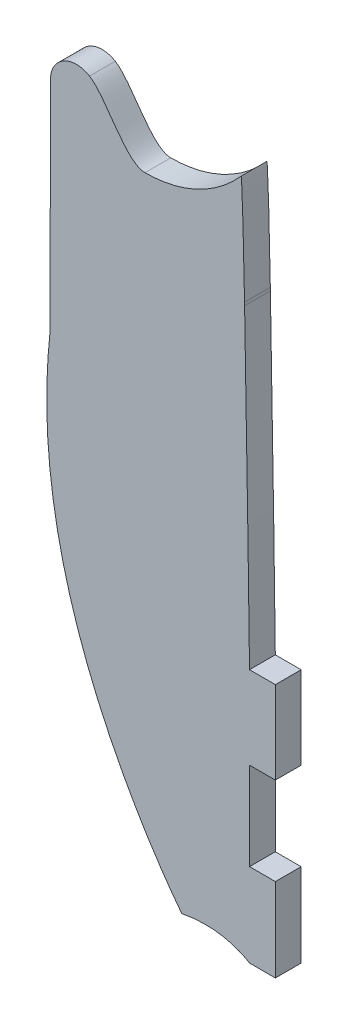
ISO-10303-21;
HEADER;
FILE_DESCRIPTION(('STEP AP214'),'2;1');
FILE_NAME('part.step','',(''),(''),'','','');
FILE_SCHEMA(('AUTOMOTIVE_DESIGN { 1 0 10303 214 1 1 1 1 }'));
ENDSEC;
DATA;
#1=APPLICATION_CONTEXT('core data for automotive mechanical design processes');
#2=APPLICATION_PROTOCOL_DEFINITION('international standard','automotive_design',2000,#1);
#3=PRODUCT_CONTEXT('',#1,'mechanical');
#4=PRODUCT('Part','Part','',(#3));
#5=PRODUCT_RELATED_PRODUCT_CATEGORY('part','',(#4));
#6=PRODUCT_DEFINITION_FORMATION('','',#4);
#7=PRODUCT_DEFINITION_CONTEXT('part definition',#1,'design');
#8=PRODUCT_DEFINITION('design','',#6,#7);
#9=PRODUCT_DEFINITION_SHAPE('','',#8);
#10=(LENGTH_UNIT() NAMED_UNIT(*) SI_UNIT(.MILLI.,.METRE.));
#11=(NAMED_UNIT(*) PLANE_ANGLE_UNIT() SI_UNIT($,.RADIAN.));
#12=(NAMED_UNIT(*) SI_UNIT($,.STERADIAN.) SOLID_ANGLE_UNIT());
#13=UNCERTAINTY_MEASURE_WITH_UNIT(LENGTH_MEASURE(1.E-05),#10,'distance_accuracy_value','');
#14=(GEOMETRIC_REPRESENTATION_CONTEXT(3) GLOBAL_UNCERTAINTY_ASSIGNED_CONTEXT((#13)) GLOBAL_UNIT_ASSIGNED_CONTEXT((#10,
#11,#12)) REPRESENTATION_CONTEXT('',''));
#15=CARTESIAN_POINT('',(0.,0.,0.));
#16=DIRECTION('',(0.,0.,1.));
#17=DIRECTION('',(1.,0.,0.));
#18=AXIS2_PLACEMENT_3D('',#15,#16,#17);
#19=CARTESIAN_POINT('',(835.767998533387,209.913527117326,3.));
#20=DIRECTION('',(0.,1.,0.));
#21=DIRECTION('',(0.,0.,1.));
#22=AXIS2_PLACEMENT_3D('',#19,#20,#21);
#23=PLANE('',#22);
#24=DIRECTION('',(1.,0.,0.));
#25=VECTOR('',#24,1.);
#26=CARTESIAN_POINT('',(835.767998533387,209.913527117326,0.));
#27=LINE('',#26,#25);
#28=CARTESIAN_POINT('',(835.767998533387,209.913527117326,0.));
#29=VERTEX_POINT('',#28);
#30=CARTESIAN_POINT('',(838.777203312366,209.913527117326,0.));
#31=VERTEX_POINT('',#30);
#32=EDGE_CURVE('E11',#29,#31,#27,.T.);
#33=ORIENTED_EDGE('',*,*,#32,.T.);
#34=DIRECTION('',(0.,0.,-1.));
#35=VECTOR('',#34,1.);
#36=CARTESIAN_POINT('',(838.777203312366,209.913527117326,3.));
#37=LINE('',#36,#35);
#38=CARTESIAN_POINT('',(838.777203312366,209.913527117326,3.));
#39=VERTEX_POINT('',#38);
#40=EDGE_CURVE('E196',#39,#31,#37,.T.);
#41=ORIENTED_EDGE('',*,*,#40,.F.);
#42=DIRECTION('',(1.,0.,0.));
#43=VECTOR('',#42,1.);
#44=CARTESIAN_POINT('',(835.767998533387,209.913527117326,3.));
#45=LINE('',#44,#43);
#46=CARTESIAN_POINT('',(835.767998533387,209.913527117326,3.));
#47=VERTEX_POINT('',#46);
#48=EDGE_CURVE('E129',#47,#39,#45,.T.);
#49=ORIENTED_EDGE('',*,*,#48,.F.);
#50=DIRECTION('',(0.,0.,-1.));
#51=VECTOR('',#50,1.);
#52=CARTESIAN_POINT('',(835.767998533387,209.913527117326,3.));
#53=LINE('',#52,#51);
#54=EDGE_CURVE('E471',#47,#29,#53,.T.);
#55=ORIENTED_EDGE('',*,*,#54,.T.);
#56=EDGE_LOOP('',(#33,#41,#49,#55));
#57=FACE_BOUND('',#56,.T.);
#58=ADVANCED_FACE('F44',(#57),#23,.F.);
#59=CARTESIAN_POINT('',(838.777203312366,209.913527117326,3.));
#60=DIRECTION('',(-1.,0.,0.));
#61=DIRECTION('',(0.,0.,1.));
#62=AXIS2_PLACEMENT_3D('',#59,#60,#61);
#63=PLANE('',#62);
#64=DIRECTION('',(0.,1.,0.));
#65=VECTOR('',#64,1.);
#66=CARTESIAN_POINT('',(838.777203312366,209.913527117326,0.));
#67=LINE('',#66,#65);
#68=CARTESIAN_POINT('',(838.777203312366,219.534817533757,0.));
#69=VERTEX_POINT('',#68);
#70=EDGE_CURVE('E57',#31,#69,#67,.T.);
#71=ORIENTED_EDGE('',*,*,#70,.T.);
#72=DIRECTION('',(0.,0.,-1.));
#73=VECTOR('',#72,1.);
#74=CARTESIAN_POINT('',(838.777203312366,219.534817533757,3.));
#75=LINE('',#74,#73);
#76=CARTESIAN_POINT('',(838.777203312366,219.534817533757,3.));
#77=VERTEX_POINT('',#76);
#78=EDGE_CURVE('E198',#77,#69,#75,.T.);
#79=ORIENTED_EDGE('',*,*,#78,.F.);
#80=DIRECTION('',(0.,1.,0.));
#81=VECTOR('',#80,1.);
#82=CARTESIAN_POINT('',(838.777203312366,209.913527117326,3.));
#83=LINE('',#82,#81);
#84=EDGE_CURVE('E308',#39,#77,#83,.T.);
#85=ORIENTED_EDGE('',*,*,#84,.F.);
#86=ORIENTED_EDGE('',*,*,#40,.T.);
#87=EDGE_LOOP('',(#71,#79,#85,#86));
#88=FACE_BOUND('',#87,.T.);
#89=ADVANCED_FACE('F191',(#88),#63,.F.);
#90=CARTESIAN_POINT('',(838.777203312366,219.534817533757,3.));
#91=DIRECTION('',(0.,-1.,0.));
#92=DIRECTION('',(0.,0.,-1.));
#93=AXIS2_PLACEMENT_3D('',#90,#91,#92);
#94=PLANE('',#93);
#95=DIRECTION('',(-1.,0.,0.));
#96=VECTOR('',#95,1.);
#97=CARTESIAN_POINT('',(838.777203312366,219.534817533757,0.));
#98=LINE('',#97,#96);
#99=CARTESIAN_POINT('',(835.767998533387,219.534817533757,0.));
#100=VERTEX_POINT('',#99);
#101=EDGE_CURVE('E201',#69,#100,#98,.T.);
#102=ORIENTED_EDGE('',*,*,#101,.T.);
#103=DIRECTION('',(0.,0.,-1.));
#104=VECTOR('',#103,1.);
#105=CARTESIAN_POINT('',(835.767998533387,219.534817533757,3.));
#106=LINE('',#105,#104);
#107=CARTESIAN_POINT('',(835.767998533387,219.534817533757,3.));
#108=VERTEX_POINT('',#107);
#109=EDGE_CURVE('E211',#108,#100,#106,.T.);
#110=ORIENTED_EDGE('',*,*,#109,.F.);
#111=DIRECTION('',(-1.,0.,0.));
#112=VECTOR('',#111,1.);
#113=CARTESIAN_POINT('',(838.777203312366,219.534817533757,3.));
#114=LINE('',#113,#112);
#115=EDGE_CURVE('E207',#77,#108,#114,.T.);
#116=ORIENTED_EDGE('',*,*,#115,.F.);
#117=ORIENTED_EDGE('',*,*,#78,.T.);
#118=EDGE_LOOP('',(#102,#110,#116,#117));
#119=FACE_BOUND('',#118,.T.);
#120=ADVANCED_FACE('F206',(#119),#94,.F.);
#121=CARTESIAN_POINT('',(835.767998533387,219.534817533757,3.));
#122=CARTESIAN_POINT('',(835.767998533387,219.879843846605,3.));
#123=CARTESIAN_POINT('',(835.486878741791,241.454237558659,3.));
#124=CARTESIAN_POINT('',(835.196457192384,255.926394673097,3.));
#125=B_SPLINE_CURVE_WITH_KNOTS('',3,(#121,#122,#123,#124),.UNSPECIFIED.,.F.,.F.,(4,4),(4.,5.),.UNSPECIFIED.);
#126=DIRECTION('',(0.,0.,-1.));
#127=VECTOR('',#126,1.);
#128=SURFACE_OF_LINEAR_EXTRUSION('',#125,#127);
#129=CARTESIAN_POINT('',(835.767998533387,219.534817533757,0.));
#130=CARTESIAN_POINT('',(835.767998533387,219.879843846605,0.));
#131=CARTESIAN_POINT('',(835.486878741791,241.454237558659,0.));
#132=CARTESIAN_POINT('',(835.196457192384,255.926394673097,0.));
#133=B_SPLINE_CURVE_WITH_KNOTS('',3,(#129,#130,#131,#132),.UNSPECIFIED.,.F.,.F.,(4,4),(4.,5.),.UNSPECIFIED.);
#134=CARTESIAN_POINT('',(835.196457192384,255.926394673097,0.));
#135=VERTEX_POINT('',#134);
#136=EDGE_CURVE('E216',#100,#135,#133,.T.);
#137=ORIENTED_EDGE('',*,*,#136,.T.);
#138=DIRECTION('',(0.,0.,-1.));
#139=VECTOR('',#138,1.);
#140=CARTESIAN_POINT('',(835.196457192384,255.926394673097,3.));
#141=LINE('',#140,#139);
#142=CARTESIAN_POINT('',(835.196457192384,255.926394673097,3.));
#143=VERTEX_POINT('',#142);
#144=EDGE_CURVE('E396',#143,#135,#141,.T.);
#145=ORIENTED_EDGE('',*,*,#144,.F.);
#146=EDGE_CURVE('E295',#108,#143,#125,.T.);
#147=ORIENTED_EDGE('',*,*,#146,.F.);
#148=ORIENTED_EDGE('',*,*,#109,.T.);
#149=EDGE_LOOP('',(#137,#145,#147,#148));
#150=FACE_BOUND('',#149,.T.);
#151=ADVANCED_FACE('F282',(#150),#128,.F.);
#152=CARTESIAN_POINT('',(835.196457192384,255.926394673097,3.));
#153=DIRECTION('',(-0.999790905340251,-0.0204486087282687,0.));
#154=DIRECTION('',(0.0204486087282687,-0.999790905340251,0.));
#155=AXIS2_PLACEMENT_3D('',#152,#153,#154);
#156=PLANE('',#155);
#157=DIRECTION('',(-0.0204486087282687,0.999790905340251,0.));
#158=VECTOR('',#157,1.);
#159=CARTESIAN_POINT('',(835.196457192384,255.926394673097,0.));
#160=LINE('',#159,#158);
#161=CARTESIAN_POINT('',(835.189222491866,256.280119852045,0.));
#162=VERTEX_POINT('',#161);
#163=EDGE_CURVE('E219',#135,#162,#160,.T.);
#164=ORIENTED_EDGE('',*,*,#163,.T.);
#165=DIRECTION('',(0.,0.,-1.));
#166=VECTOR('',#165,1.);
#167=CARTESIAN_POINT('',(835.189222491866,256.280119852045,3.));
#168=LINE('',#167,#166);
#169=CARTESIAN_POINT('',(835.189222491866,256.280119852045,3.));
#170=VERTEX_POINT('',#169);
#171=EDGE_CURVE('E397',#170,#162,#168,.T.);
#172=ORIENTED_EDGE('',*,*,#171,.F.);
#173=DIRECTION('',(-0.0204486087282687,0.999790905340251,0.));
#174=VECTOR('',#173,1.);
#175=CARTESIAN_POINT('',(835.196457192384,255.926394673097,3.));
#176=LINE('',#175,#174);
#177=EDGE_CURVE('E298',#143,#170,#176,.T.);
#178=ORIENTED_EDGE('',*,*,#177,.F.);
#179=ORIENTED_EDGE('',*,*,#144,.T.);
#180=EDGE_LOOP('',(#164,#172,#178,#179));
#181=FACE_BOUND('',#180,.T.);
#182=ADVANCED_FACE('F286',(#181),#156,.F.);
#183=CARTESIAN_POINT('',(835.189222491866,256.280119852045,3.));
#184=CARTESIAN_POINT('',(835.042633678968,263.520849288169,3.));
#185=CARTESIAN_POINT('',(834.894322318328,268.897523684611,3.));
#186=CARTESIAN_POINT('',(834.778997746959,268.767126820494,3.));
#187=B_SPLINE_CURVE_WITH_KNOTS('',3,(#183,#184,#185,#186),.UNSPECIFIED.,.F.,.F.,(4,4),(6.,7.),.UNSPECIFIED.);
#188=DIRECTION('',(0.,0.,-1.));
#189=VECTOR('',#188,1.);
#190=SURFACE_OF_LINEAR_EXTRUSION('',#187,#189);
#191=CARTESIAN_POINT('',(835.189222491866,256.280119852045,0.));
#192=CARTESIAN_POINT('',(835.042633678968,263.520849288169,0.));
#193=CARTESIAN_POINT('',(834.894322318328,268.897523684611,0.));
#194=CARTESIAN_POINT('',(834.778997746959,268.767126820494,0.));
#195=B_SPLINE_CURVE_WITH_KNOTS('',3,(#191,#192,#193,#194),.UNSPECIFIED.,.F.,.F.,(4,4),(6.,7.),.UNSPECIFIED.);
#196=CARTESIAN_POINT('',(834.778997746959,268.767126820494,0.));
#197=VERTEX_POINT('',#196);
#198=EDGE_CURVE('E379',#162,#197,#195,.T.);
#199=ORIENTED_EDGE('',*,*,#198,.T.);
#200=DIRECTION('',(0.,0.,-1.));
#201=VECTOR('',#200,1.);
#202=CARTESIAN_POINT('',(834.778997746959,268.767126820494,3.));
#203=LINE('',#202,#201);
#204=CARTESIAN_POINT('',(834.778997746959,268.767126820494,3.));
#205=VERTEX_POINT('',#204);
#206=EDGE_CURVE('E406',#205,#197,#203,.T.);
#207=ORIENTED_EDGE('',*,*,#206,.F.);
#208=EDGE_CURVE('E403',#170,#205,#187,.T.);
#209=ORIENTED_EDGE('',*,*,#208,.F.);
#210=ORIENTED_EDGE('',*,*,#171,.T.);
#211=EDGE_LOOP('',(#199,#207,#209,#210));
#212=FACE_BOUND('',#211,.T.);
#213=ADVANCED_FACE('F405',(#212),#190,.F.);
#214=CARTESIAN_POINT('',(834.778997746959,268.767126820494,3.));
#215=CARTESIAN_POINT('',(831.920688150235,265.536316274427,3.));
#216=CARTESIAN_POINT('',(827.968819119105,263.537816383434,3.));
#217=CARTESIAN_POINT('',(823.604227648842,263.537816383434,3.));
#218=B_SPLINE_CURVE_WITH_KNOTS('',3,(#214,#215,#216,#217),.UNSPECIFIED.,.F.,.F.,(4,4),(7.,8.),.UNSPECIFIED.);
#219=DIRECTION('',(0.,0.,-1.));
#220=VECTOR('',#219,1.);
#221=SURFACE_OF_LINEAR_EXTRUSION('',#218,#220);
#222=CARTESIAN_POINT('',(834.778997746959,268.767126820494,0.));
#223=CARTESIAN_POINT('',(831.920688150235,265.536316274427,0.));
#224=CARTESIAN_POINT('',(827.968819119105,263.537816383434,0.));
#225=CARTESIAN_POINT('',(823.604227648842,263.537816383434,0.));
#226=B_SPLINE_CURVE_WITH_KNOTS('',3,(#222,#223,#224,#225),.UNSPECIFIED.,.F.,.F.,(4,4),(7.,8.),.UNSPECIFIED.);
#227=CARTESIAN_POINT('',(823.604227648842,263.537816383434,0.));
#228=VERTEX_POINT('',#227);
#229=EDGE_CURVE('E375',#197,#228,#226,.T.);
#230=ORIENTED_EDGE('',*,*,#229,.T.);
#231=DIRECTION('',(0.,0.,-1.));
#232=VECTOR('',#231,1.);
#233=CARTESIAN_POINT('',(823.604227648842,263.537816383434,3.));
#234=LINE('',#233,#232);
#235=CARTESIAN_POINT('',(823.604227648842,263.537816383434,3.));
#236=VERTEX_POINT('',#235);
#237=EDGE_CURVE('E417',#236,#228,#234,.T.);
#238=ORIENTED_EDGE('',*,*,#237,.F.);
#239=EDGE_CURVE('E484',#205,#236,#218,.T.);
#240=ORIENTED_EDGE('',*,*,#239,.F.);
#241=ORIENTED_EDGE('',*,*,#206,.T.);
#242=EDGE_LOOP('',(#230,#238,#240,#241));
#243=FACE_BOUND('',#242,.T.);
#244=ADVANCED_FACE('F413',(#243),#221,.F.);
#245=CARTESIAN_POINT('',(823.604227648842,263.537816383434,3.));
#246=CARTESIAN_POINT('',(821.305832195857,263.537816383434,3.));
#247=CARTESIAN_POINT('',(819.121813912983,268.851359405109,3.));
#248=CARTESIAN_POINT('',(817.151563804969,270.037850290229,3.));
#249=B_SPLINE_CURVE_WITH_KNOTS('',3,(#245,#246,#247,#248),.UNSPECIFIED.,.F.,.F.,(4,4),(8.,9.),.UNSPECIFIED.);
#250=DIRECTION('',(0.,0.,-1.));
#251=VECTOR('',#250,1.);
#252=SURFACE_OF_LINEAR_EXTRUSION('',#249,#251);
#253=CARTESIAN_POINT('',(823.604227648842,263.537816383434,0.));
#254=CARTESIAN_POINT('',(821.305832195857,263.537816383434,0.));
#255=CARTESIAN_POINT('',(819.121813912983,268.851359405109,0.));
#256=CARTESIAN_POINT('',(817.151563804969,270.037850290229,0.));
#257=B_SPLINE_CURVE_WITH_KNOTS('',3,(#253,#254,#255,#256),.UNSPECIFIED.,.F.,.F.,(4,4),(8.,9.),.UNSPECIFIED.);
#258=CARTESIAN_POINT('',(817.151563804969,270.037850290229,0.));
#259=VERTEX_POINT('',#258);
#260=EDGE_CURVE('E365',#228,#259,#257,.T.);
#261=ORIENTED_EDGE('',*,*,#260,.T.);
#262=DIRECTION('',(0.,0.,-1.));
#263=VECTOR('',#262,1.);
#264=CARTESIAN_POINT('',(817.151563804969,270.037850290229,3.));
#265=LINE('',#264,#263);
#266=CARTESIAN_POINT('',(817.151563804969,270.037850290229,3.));
#267=VERTEX_POINT('',#266);
#268=EDGE_CURVE('E422',#267,#259,#265,.T.);
#269=ORIENTED_EDGE('',*,*,#268,.F.);
#270=EDGE_CURVE('E421',#236,#267,#249,.T.);
#271=ORIENTED_EDGE('',*,*,#270,.F.);
#272=ORIENTED_EDGE('',*,*,#237,.T.);
#273=EDGE_LOOP('',(#261,#269,#271,#272));
#274=FACE_BOUND('',#273,.T.);
#275=ADVANCED_FACE('F419',(#274),#252,.F.);
#276=CARTESIAN_POINT('',(817.151563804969,270.037850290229,3.));
#277=CARTESIAN_POINT('',(815.161676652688,271.236054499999,3.));
#278=CARTESIAN_POINT('',(812.62470833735,269.777487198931,3.));
#279=CARTESIAN_POINT('',(812.611875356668,267.454717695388,3.));
#280=B_SPLINE_CURVE_WITH_KNOTS('',3,(#276,#277,#278,#279),.UNSPECIFIED.,.F.,.F.,(4,4),(9.,10.),.UNSPECIFIED.);
#281=DIRECTION('',(0.,0.,-1.));
#282=VECTOR('',#281,1.);
#283=SURFACE_OF_LINEAR_EXTRUSION('',#280,#282);
#284=CARTESIAN_POINT('',(817.151563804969,270.037850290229,0.));
#285=CARTESIAN_POINT('',(815.161676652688,271.236054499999,0.));
#286=CARTESIAN_POINT('',(812.62470833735,269.777487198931,0.));
#287=CARTESIAN_POINT('',(812.611875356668,267.454717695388,0.));
#288=B_SPLINE_CURVE_WITH_KNOTS('',3,(#284,#285,#286,#287),.UNSPECIFIED.,.F.,.F.,(4,4),(9.,10.),.UNSPECIFIED.);
#289=CARTESIAN_POINT('',(812.611875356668,267.454717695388,0.));
#290=VERTEX_POINT('',#289);
#291=EDGE_CURVE('E356',#259,#290,#288,.T.);
#292=ORIENTED_EDGE('',*,*,#291,.T.);
#293=DIRECTION('',(0.,0.,-1.));
#294=VECTOR('',#293,1.);
#295=CARTESIAN_POINT('',(812.611875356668,267.454717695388,3.));
#296=LINE('',#295,#294);
#297=CARTESIAN_POINT('',(812.611875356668,267.454717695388,3.));
#298=VERTEX_POINT('',#297);
#299=EDGE_CURVE('E427',#298,#290,#296,.T.);
#300=ORIENTED_EDGE('',*,*,#299,.F.);
#301=EDGE_CURVE('E512',#267,#298,#280,.T.);
#302=ORIENTED_EDGE('',*,*,#301,.F.);
#303=ORIENTED_EDGE('',*,*,#268,.T.);
#304=EDGE_LOOP('',(#292,#300,#302,#303));
#305=FACE_BOUND('',#304,.T.);
#306=ADVANCED_FACE('F503',(#305),#283,.F.);
#307=CARTESIAN_POINT('',(812.611875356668,267.454717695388,3.));
#308=DIRECTION('',(0.999997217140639,-0.00235917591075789,0.));
#309=DIRECTION('',(0.00235917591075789,0.999997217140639,0.));
#310=AXIS2_PLACEMENT_3D('',#307,#308,#309);
#311=PLANE('',#310);
#312=DIRECTION('',(-0.00235917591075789,-0.999997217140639,0.));
#313=VECTOR('',#312,1.);
#314=CARTESIAN_POINT('',(812.611875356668,267.454717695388,0.));
#315=LINE('',#314,#313);
#316=CARTESIAN_POINT('',(812.578630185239,253.362899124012,0.));
#317=VERTEX_POINT('',#316);
#318=EDGE_CURVE('E357',#290,#317,#315,.T.);
#319=ORIENTED_EDGE('',*,*,#318,.T.);
#320=DIRECTION('',(0.,0.,-1.));
#321=VECTOR('',#320,1.);
#322=CARTESIAN_POINT('',(812.578630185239,253.362899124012,3.));
#323=LINE('',#322,#321);
#324=CARTESIAN_POINT('',(812.578630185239,253.362899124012,3.));
#325=VERTEX_POINT('',#324);
#326=EDGE_CURVE('E436',#325,#317,#323,.T.);
#327=ORIENTED_EDGE('',*,*,#326,.F.);
#328=DIRECTION('',(-0.00235917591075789,-0.999997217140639,0.));
#329=VECTOR('',#328,1.);
#330=CARTESIAN_POINT('',(812.611875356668,267.454717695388,3.));
#331=LINE('',#330,#329);
#332=EDGE_CURVE('E517',#298,#325,#331,.T.);
#333=ORIENTED_EDGE('',*,*,#332,.F.);
#334=ORIENTED_EDGE('',*,*,#299,.T.);
#335=EDGE_LOOP('',(#319,#327,#333,#334));
#336=FACE_BOUND('',#335,.T.);
#337=ADVANCED_FACE('F588',(#336),#311,.F.);
#338=CARTESIAN_POINT('',(812.578630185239,253.362899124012,3.));
#339=DIRECTION('',(0.999997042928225,-0.00243189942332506,0.));
#340=DIRECTION('',(0.00243189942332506,0.999997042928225,0.));
#341=AXIS2_PLACEMENT_3D('',#338,#339,#340);
#342=PLANE('',#341);
#343=DIRECTION('',(-0.00243189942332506,-0.999997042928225,0.));
#344=VECTOR('',#343,1.);
#345=CARTESIAN_POINT('',(812.578630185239,253.362899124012,0.));
#346=LINE('',#345,#344);
#347=CARTESIAN_POINT('',(812.577768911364,253.008743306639,0.));
#348=VERTEX_POINT('',#347);
#349=EDGE_CURVE('E355',#317,#348,#346,.T.);
#350=ORIENTED_EDGE('',*,*,#349,.T.);
#351=DIRECTION('',(0.,0.,-1.));
#352=VECTOR('',#351,1.);
#353=CARTESIAN_POINT('',(812.577768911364,253.008743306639,3.));
#354=LINE('',#353,#352);
#355=CARTESIAN_POINT('',(812.577768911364,253.008743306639,3.));
#356=VERTEX_POINT('',#355);
#357=EDGE_CURVE('E439',#356,#348,#354,.T.);
#358=ORIENTED_EDGE('',*,*,#357,.F.);
#359=DIRECTION('',(-0.00243189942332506,-0.999997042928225,0.));
#360=VECTOR('',#359,1.);
#361=CARTESIAN_POINT('',(812.578630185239,253.362899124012,3.));
#362=LINE('',#361,#360);
#363=EDGE_CURVE('E528',#325,#356,#362,.T.);
#364=ORIENTED_EDGE('',*,*,#363,.F.);
#365=ORIENTED_EDGE('',*,*,#326,.T.);
#366=EDGE_LOOP('',(#350,#358,#364,#365));
#367=FACE_BOUND('',#366,.T.);
#368=ADVANCED_FACE('F582',(#367),#342,.F.);
#369=CARTESIAN_POINT('',(812.577768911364,253.008743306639,3.));
#370=DIRECTION('',(0.999997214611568,-0.00236024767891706,0.));
#371=DIRECTION('',(0.00236024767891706,0.999997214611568,0.));
#372=AXIS2_PLACEMENT_3D('',#369,#370,#371);
#373=PLANE('',#372);
#374=DIRECTION('',(-0.00236024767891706,-0.999997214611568,0.));
#375=VECTOR('',#374,1.);
#376=CARTESIAN_POINT('',(812.577768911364,253.008743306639,0.));
#377=LINE('',#376,#375);
#378=CARTESIAN_POINT('',(812.551672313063,241.952053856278,0.));
#379=VERTEX_POINT('',#378);
#380=EDGE_CURVE('E350',#348,#379,#377,.T.);
#381=ORIENTED_EDGE('',*,*,#380,.T.);
#382=DIRECTION('',(0.,0.,-1.));
#383=VECTOR('',#382,1.);
#384=CARTESIAN_POINT('',(812.551672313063,241.952053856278,3.));
#385=LINE('',#384,#383);
#386=CARTESIAN_POINT('',(812.551672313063,241.952053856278,3.));
#387=VERTEX_POINT('',#386);
#388=EDGE_CURVE('E441',#387,#379,#385,.T.);
#389=ORIENTED_EDGE('',*,*,#388,.F.);
#390=DIRECTION('',(-0.00236024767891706,-0.999997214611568,0.));
#391=VECTOR('',#390,1.);
#392=CARTESIAN_POINT('',(812.577768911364,253.008743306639,3.));
#393=LINE('',#392,#391);
#394=EDGE_CURVE('E530',#356,#387,#393,.T.);
#395=ORIENTED_EDGE('',*,*,#394,.F.);
#396=ORIENTED_EDGE('',*,*,#357,.T.);
#397=EDGE_LOOP('',(#381,#389,#395,#396));
#398=FACE_BOUND('',#397,.T.);
#399=ADVANCED_FACE('F546',(#398),#373,.F.);
#400=CARTESIAN_POINT('',(812.551672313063,241.952053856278,3.));
#401=CARTESIAN_POINT('',(810.095491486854,219.183073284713,3.));
#402=CARTESIAN_POINT('',(823.676746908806,197.12559105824,3.));
#403=B_SPLINE_CURVE_WITH_KNOTS('',2,(#400,#401,#402),.UNSPECIFIED.,.F.,.F.,(3,3),(13.,14.),.UNSPECIFIED.);
#404=DIRECTION('',(0.,0.,-1.));
#405=VECTOR('',#404,1.);
#406=SURFACE_OF_LINEAR_EXTRUSION('',#403,#405);
#407=CARTESIAN_POINT('',(812.551672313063,241.952053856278,0.));
#408=CARTESIAN_POINT('',(810.095491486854,219.183073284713,0.));
#409=CARTESIAN_POINT('',(823.676746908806,197.12559105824,0.));
#410=B_SPLINE_CURVE_WITH_KNOTS('',2,(#407,#408,#409),.UNSPECIFIED.,.F.,.F.,(3,3),(13.,14.),.UNSPECIFIED.);
#411=CARTESIAN_POINT('',(823.676746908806,197.12559105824,0.));
#412=VERTEX_POINT('',#411);
#413=EDGE_CURVE('E344',#379,#412,#410,.T.);
#414=ORIENTED_EDGE('',*,*,#413,.T.);
#415=DIRECTION('',(0.,0.,-1.));
#416=VECTOR('',#415,1.);
#417=CARTESIAN_POINT('',(823.676746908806,197.12559105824,3.));
#418=LINE('',#417,#416);
#419=CARTESIAN_POINT('',(823.676746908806,197.12559105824,3.));
#420=VERTEX_POINT('',#419);
#421=EDGE_CURVE('E450',#420,#412,#418,.T.);
#422=ORIENTED_EDGE('',*,*,#421,.F.);
#423=EDGE_CURVE('E535',#387,#420,#403,.T.);
#424=ORIENTED_EDGE('',*,*,#423,.F.);
#425=ORIENTED_EDGE('',*,*,#388,.T.);
#426=EDGE_LOOP('',(#414,#422,#424,#425));
#427=FACE_BOUND('',#426,.T.);
#428=ADVANCED_FACE('F545',(#427),#406,.F.);
#429=CARTESIAN_POINT('',(823.676746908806,197.12559105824,3.));
#430=DIRECTION('',(0.852165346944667,0.523272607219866,0.));
#431=DIRECTION('',(-0.523272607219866,0.852165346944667,0.));
#432=AXIS2_PLACEMENT_3D('',#429,#430,#431);
#433=PLANE('',#432);
#434=DIRECTION('',(0.523272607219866,-0.852165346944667,0.));
#435=VECTOR('',#434,1.);
#436=CARTESIAN_POINT('',(823.676746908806,197.12559105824,0.));
#437=LINE('',#436,#435);
#438=CARTESIAN_POINT('',(823.856667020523,196.832585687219,0.));
#439=VERTEX_POINT('',#438);
#440=EDGE_CURVE('E339',#412,#439,#437,.T.);
#441=ORIENTED_EDGE('',*,*,#440,.T.);
#442=DIRECTION('',(0.,0.,-1.));
#443=VECTOR('',#442,1.);
#444=CARTESIAN_POINT('',(823.856667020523,196.832585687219,3.));
#445=LINE('',#444,#443);
#446=CARTESIAN_POINT('',(823.856667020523,196.832585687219,3.));
#447=VERTEX_POINT('',#446);
#448=EDGE_CURVE('E454',#447,#439,#445,.T.);
#449=ORIENTED_EDGE('',*,*,#448,.F.);
#450=DIRECTION('',(0.523272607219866,-0.852165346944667,0.));
#451=VECTOR('',#450,1.);
#452=CARTESIAN_POINT('',(823.676746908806,197.12559105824,3.));
#453=LINE('',#452,#451);
#454=EDGE_CURVE('E540',#420,#447,#453,.T.);
#455=ORIENTED_EDGE('',*,*,#454,.F.);
#456=ORIENTED_EDGE('',*,*,#421,.T.);
#457=EDGE_LOOP('',(#441,#449,#455,#456));
#458=FACE_BOUND('',#457,.T.);
#459=ADVANCED_FACE('F544',(#458),#433,.F.);
#460=CARTESIAN_POINT('',(823.856667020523,196.832585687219,3.));
#461=CARTESIAN_POINT('',(825.070718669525,194.881886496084,3.));
#462=CARTESIAN_POINT('',(826.408879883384,192.937388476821,3.));
#463=CARTESIAN_POINT('',(827.888117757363,191.015714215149,3.));
#464=B_SPLINE_CURVE_WITH_KNOTS('',3,(#460,#461,#462,#463),.UNSPECIFIED.,.F.,.F.,(4,4),(15.,16.),.UNSPECIFIED.);
#465=DIRECTION('',(0.,0.,-1.));
#466=VECTOR('',#465,1.);
#467=SURFACE_OF_LINEAR_EXTRUSION('',#464,#466);
#468=CARTESIAN_POINT('',(823.856667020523,196.832585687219,0.));
#469=CARTESIAN_POINT('',(825.070718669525,194.881886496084,0.));
#470=CARTESIAN_POINT('',(826.408879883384,192.937388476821,0.));
#471=CARTESIAN_POINT('',(827.888117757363,191.015714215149,0.));
#472=B_SPLINE_CURVE_WITH_KNOTS('',3,(#468,#469,#470,#471),.UNSPECIFIED.,.F.,.F.,(4,4),(15.,16.),.UNSPECIFIED.);
#473=CARTESIAN_POINT('',(827.888117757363,191.015714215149,0.));
#474=VERTEX_POINT('',#473);
#475=EDGE_CURVE('E327',#439,#474,#472,.T.);
#476=ORIENTED_EDGE('',*,*,#475,.T.);
#477=DIRECTION('',(0.,0.,-1.));
#478=VECTOR('',#477,1.);
#479=CARTESIAN_POINT('',(827.888117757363,191.015714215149,3.));
#480=LINE('',#479,#478);
#481=CARTESIAN_POINT('',(827.888117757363,191.015714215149,3.));
#482=VERTEX_POINT('',#481);
#483=EDGE_CURVE('E457',#482,#474,#480,.T.);
#484=ORIENTED_EDGE('',*,*,#483,.F.);
#485=EDGE_CURVE('E241',#447,#482,#464,.T.);
#486=ORIENTED_EDGE('',*,*,#485,.F.);
#487=ORIENTED_EDGE('',*,*,#448,.T.);
#488=EDGE_LOOP('',(#476,#484,#486,#487));
#489=FACE_BOUND('',#488,.T.);
#490=ADVANCED_FACE('F258',(#489),#467,.F.);
#491=CARTESIAN_POINT('',(827.888117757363,191.015714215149,3.));
#492=CARTESIAN_POINT('',(832.487750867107,191.908080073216,3.));
#493=CARTESIAN_POINT('',(835.767998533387,189.97029999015,3.));
#494=B_SPLINE_CURVE_WITH_KNOTS('',2,(#491,#492,#493),.UNSPECIFIED.,.F.,.F.,(3,3),(16.,17.),.UNSPECIFIED.);
#495=DIRECTION('',(0.,0.,-1.));
#496=VECTOR('',#495,1.);
#497=SURFACE_OF_LINEAR_EXTRUSION('',#494,#496);
#498=CARTESIAN_POINT('',(827.888117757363,191.015714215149,0.));
#499=CARTESIAN_POINT('',(832.487750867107,191.908080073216,0.));
#500=CARTESIAN_POINT('',(835.767998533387,189.97029999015,0.));
#501=B_SPLINE_CURVE_WITH_KNOTS('',2,(#498,#499,#500),.UNSPECIFIED.,.F.,.F.,(3,3),(16.,17.),.UNSPECIFIED.);
#502=CARTESIAN_POINT('',(835.767998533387,189.97029999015,0.));
#503=VERTEX_POINT('',#502);
#504=EDGE_CURVE('E323',#474,#503,#501,.T.);
#505=ORIENTED_EDGE('',*,*,#504,.T.);
#506=DIRECTION('',(0.,0.,-1.));
#507=VECTOR('',#506,1.);
#508=CARTESIAN_POINT('',(835.767998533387,189.97029999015,3.));
#509=LINE('',#508,#507);
#510=CARTESIAN_POINT('',(835.767998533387,189.97029999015,3.));
#511=VERTEX_POINT('',#510);
#512=EDGE_CURVE('E458',#511,#503,#509,.T.);
#513=ORIENTED_EDGE('',*,*,#512,.F.);
#514=EDGE_CURVE('E237',#482,#511,#494,.T.);
#515=ORIENTED_EDGE('',*,*,#514,.F.);
#516=ORIENTED_EDGE('',*,*,#483,.T.);
#517=EDGE_LOOP('',(#505,#513,#515,#516));
#518=FACE_BOUND('',#517,.T.);
#519=ADVANCED_FACE('F253',(#518),#497,.F.);
#520=CARTESIAN_POINT('',(835.767998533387,189.97029999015,3.));
#521=DIRECTION('',(0.,1.,0.));
#522=DIRECTION('',(0.,0.,1.));
#523=AXIS2_PLACEMENT_3D('',#520,#521,#522);
#524=PLANE('',#523);
#525=DIRECTION('',(1.,0.,0.));
#526=VECTOR('',#525,1.);
#527=CARTESIAN_POINT('',(835.767998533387,189.97029999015,0.));
#528=LINE('',#527,#526);
#529=CARTESIAN_POINT('',(838.777203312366,189.97029999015,0.));
#530=VERTEX_POINT('',#529);
#531=EDGE_CURVE('E319',#503,#530,#528,.T.);
#532=ORIENTED_EDGE('',*,*,#531,.T.);
#533=DIRECTION('',(0.,0.,-1.));
#534=VECTOR('',#533,1.);
#535=CARTESIAN_POINT('',(838.777203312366,189.97029999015,3.));
#536=LINE('',#535,#534);
#537=CARTESIAN_POINT('',(838.777203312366,189.97029999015,3.));
#538=VERTEX_POINT('',#537);
#539=EDGE_CURVE('E463',#538,#530,#536,.T.);
#540=ORIENTED_EDGE('',*,*,#539,.F.);
#541=DIRECTION('',(1.,0.,0.));
#542=VECTOR('',#541,1.);
#543=CARTESIAN_POINT('',(835.767998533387,189.97029999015,3.));
#544=LINE('',#543,#542);
#545=EDGE_CURVE('E235',#511,#538,#544,.T.);
#546=ORIENTED_EDGE('',*,*,#545,.F.);
#547=ORIENTED_EDGE('',*,*,#512,.T.);
#548=EDGE_LOOP('',(#532,#540,#546,#547));
#549=FACE_BOUND('',#548,.T.);
#550=ADVANCED_FACE('F254',(#549),#524,.F.);
#551=CARTESIAN_POINT('',(838.777203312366,189.97029999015,3.));
#552=DIRECTION('',(-1.,0.,0.));
#553=DIRECTION('',(0.,0.,1.));
#554=AXIS2_PLACEMENT_3D('',#551,#552,#553);
#555=PLANE('',#554);
#556=DIRECTION('',(0.,1.,0.));
#557=VECTOR('',#556,1.);
#558=CARTESIAN_POINT('',(838.777203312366,189.97029999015,0.));
#559=LINE('',#558,#557);
#560=CARTESIAN_POINT('',(838.777203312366,199.689344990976,0.));
#561=VERTEX_POINT('',#560);
#562=EDGE_CURVE('E311',#530,#561,#559,.T.);
#563=ORIENTED_EDGE('',*,*,#562,.T.);
#564=DIRECTION('',(0.,0.,-1.));
#565=VECTOR('',#564,1.);
#566=CARTESIAN_POINT('',(838.777203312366,199.689344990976,3.));
#567=LINE('',#566,#565);
#568=CARTESIAN_POINT('',(838.777203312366,199.689344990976,3.));
#569=VERTEX_POINT('',#568);
#570=EDGE_CURVE('E469',#569,#561,#567,.T.);
#571=ORIENTED_EDGE('',*,*,#570,.F.);
#572=DIRECTION('',(0.,1.,0.));
#573=VECTOR('',#572,1.);
#574=CARTESIAN_POINT('',(838.777203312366,189.97029999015,3.));
#575=LINE('',#574,#573);
#576=EDGE_CURVE('E228',#538,#569,#575,.T.);
#577=ORIENTED_EDGE('',*,*,#576,.F.);
#578=ORIENTED_EDGE('',*,*,#539,.T.);
#579=EDGE_LOOP('',(#563,#571,#577,#578));
#580=FACE_BOUND('',#579,.T.);
#581=ADVANCED_FACE('F261',(#580),#555,.F.);
#582=CARTESIAN_POINT('',(838.777203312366,199.689344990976,3.));
#583=DIRECTION('',(0.,-1.,0.));
#584=DIRECTION('',(0.,0.,-1.));
#585=AXIS2_PLACEMENT_3D('',#582,#583,#584);
#586=PLANE('',#585);
#587=DIRECTION('',(-1.,0.,0.));
#588=VECTOR('',#587,1.);
#589=CARTESIAN_POINT('',(838.777203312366,199.689344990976,0.));
#590=LINE('',#589,#588);
#591=CARTESIAN_POINT('',(835.767998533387,199.689344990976,0.));
#592=VERTEX_POINT('',#591);
#593=EDGE_CURVE('E138',#561,#592,#590,.T.);
#594=ORIENTED_EDGE('',*,*,#593,.T.);
#595=DIRECTION('',(0.,0.,-1.));
#596=VECTOR('',#595,1.);
#597=CARTESIAN_POINT('',(835.767998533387,199.689344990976,3.));
#598=LINE('',#597,#596);
#599=CARTESIAN_POINT('',(835.767998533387,199.689344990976,3.));
#600=VERTEX_POINT('',#599);
#601=EDGE_CURVE('E227',#600,#592,#598,.T.);
#602=ORIENTED_EDGE('',*,*,#601,.F.);
#603=DIRECTION('',(-1.,0.,0.));
#604=VECTOR('',#603,1.);
#605=CARTESIAN_POINT('',(838.777203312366,199.689344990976,3.));
#606=LINE('',#605,#604);
#607=EDGE_CURVE('E229',#569,#600,#606,.T.);
#608=ORIENTED_EDGE('',*,*,#607,.F.);
#609=ORIENTED_EDGE('',*,*,#570,.T.);
#610=EDGE_LOOP('',(#594,#602,#608,#609));
#611=FACE_BOUND('',#610,.T.);
#612=ADVANCED_FACE('F264',(#611),#586,.F.);
#613=CARTESIAN_POINT('',(835.767998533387,199.689344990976,3.));
#614=DIRECTION('',(-1.,0.,0.));
#615=DIRECTION('',(0.,0.,1.));
#616=AXIS2_PLACEMENT_3D('',#613,#614,#615);
#617=PLANE('',#616);
#618=DIRECTION('',(0.,1.,0.));
#619=VECTOR('',#618,1.);
#620=CARTESIAN_POINT('',(835.767998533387,199.689344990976,0.));
#621=LINE('',#620,#619);
#622=EDGE_CURVE('E62',#592,#29,#621,.T.);
#623=ORIENTED_EDGE('',*,*,#622,.T.);
#624=ORIENTED_EDGE('',*,*,#54,.F.);
#625=DIRECTION('',(0.,1.,0.));
#626=VECTOR('',#625,1.);
#627=CARTESIAN_POINT('',(835.767998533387,202.545845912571,3.));
#628=LINE('',#627,#626);
#629=EDGE_CURVE('E47',#600,#47,#628,.T.);
#630=ORIENTED_EDGE('',*,*,#629,.F.);
#631=ORIENTED_EDGE('',*,*,#601,.T.);
#632=EDGE_LOOP('',(#623,#624,#630,#631));
#633=FACE_BOUND('',#632,.T.);
#634=ADVANCED_FACE('F267',(#633),#617,.F.);
#635=CARTESIAN_POINT('',(835.591135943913,232.43293205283,3.));
#636=DIRECTION('',(0.,0.,-1.));
#637=DIRECTION('',(-1.,0.,0.));
#638=AXIS2_PLACEMENT_3D('',#635,#636,#637);
#639=PLANE('',#638);
#640=ORIENTED_EDGE('',*,*,#629,.T.);
#641=ORIENTED_EDGE('',*,*,#48,.T.);
#642=ORIENTED_EDGE('',*,*,#84,.T.);
#643=ORIENTED_EDGE('',*,*,#115,.T.);
#644=ORIENTED_EDGE('',*,*,#146,.T.);
#645=ORIENTED_EDGE('',*,*,#177,.T.);
#646=ORIENTED_EDGE('',*,*,#208,.T.);
#647=ORIENTED_EDGE('',*,*,#239,.T.);
#648=ORIENTED_EDGE('',*,*,#270,.T.);
#649=ORIENTED_EDGE('',*,*,#301,.T.);
#650=ORIENTED_EDGE('',*,*,#332,.T.);
#651=ORIENTED_EDGE('',*,*,#363,.T.);
#652=ORIENTED_EDGE('',*,*,#394,.T.);
#653=ORIENTED_EDGE('',*,*,#423,.T.);
#654=ORIENTED_EDGE('',*,*,#454,.T.);
#655=ORIENTED_EDGE('',*,*,#485,.T.);
#656=ORIENTED_EDGE('',*,*,#514,.T.);
#657=ORIENTED_EDGE('',*,*,#545,.T.);
#658=ORIENTED_EDGE('',*,*,#576,.T.);
#659=ORIENTED_EDGE('',*,*,#607,.T.);
#660=EDGE_LOOP('',(#640,#641,#642,#643,#644,#645,#646,#647,#648,#649,#650,#651,#652,#653,#654,
#655,#656,#657,#658,#659));
#661=FACE_BOUND('',#660,.T.);
#662=ADVANCED_FACE('F50',(#661),#639,.F.);
#663=CARTESIAN_POINT('',(835.591135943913,232.43293205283,0.));
#664=DIRECTION('',(0.,0.,-1.));
#665=DIRECTION('',(-1.,0.,0.));
#666=AXIS2_PLACEMENT_3D('',#663,#664,#665);
#667=PLANE('',#666);
#668=ORIENTED_EDGE('',*,*,#32,.F.);
#669=ORIENTED_EDGE('',*,*,#622,.F.);
#670=ORIENTED_EDGE('',*,*,#593,.F.);
#671=ORIENTED_EDGE('',*,*,#562,.F.);
#672=ORIENTED_EDGE('',*,*,#531,.F.);
#673=ORIENTED_EDGE('',*,*,#504,.F.);
#674=ORIENTED_EDGE('',*,*,#475,.F.);
#675=ORIENTED_EDGE('',*,*,#440,.F.);
#676=ORIENTED_EDGE('',*,*,#413,.F.);
#677=ORIENTED_EDGE('',*,*,#380,.F.);
#678=ORIENTED_EDGE('',*,*,#349,.F.);
#679=ORIENTED_EDGE('',*,*,#318,.F.);
#680=ORIENTED_EDGE('',*,*,#291,.F.);
#681=ORIENTED_EDGE('',*,*,#260,.F.);
#682=ORIENTED_EDGE('',*,*,#229,.F.);
#683=ORIENTED_EDGE('',*,*,#198,.F.);
#684=ORIENTED_EDGE('',*,*,#163,.F.);
#685=ORIENTED_EDGE('',*,*,#136,.F.);
#686=ORIENTED_EDGE('',*,*,#101,.F.);
#687=ORIENTED_EDGE('',*,*,#70,.F.);
#688=EDGE_LOOP('',(#668,#669,#670,#671,#672,#673,#674,#675,#676,#677,#678,#679,#680,#681,#682,
#683,#684,#685,#686,#687));
#689=FACE_BOUND('',#688,.T.);
#690=ADVANCED_FACE('F212',(#689),#667,.T.);
#691=CLOSED_SHELL('',(#58,#89,#120,#151,#182,#213,#244,#275,#306,#337,#368,#399,#428,#459,#490,
#519,#550,#581,#612,#634,#662,#690));
#692=MANIFOLD_SOLID_BREP('B2',#691);
#693=ADVANCED_BREP_SHAPE_REPRESENTATION('',(#18,#692),#14);
#694=SHAPE_DEFINITION_REPRESENTATION(#9,#693);
ENDSEC;
END-ISO-10303-21;
